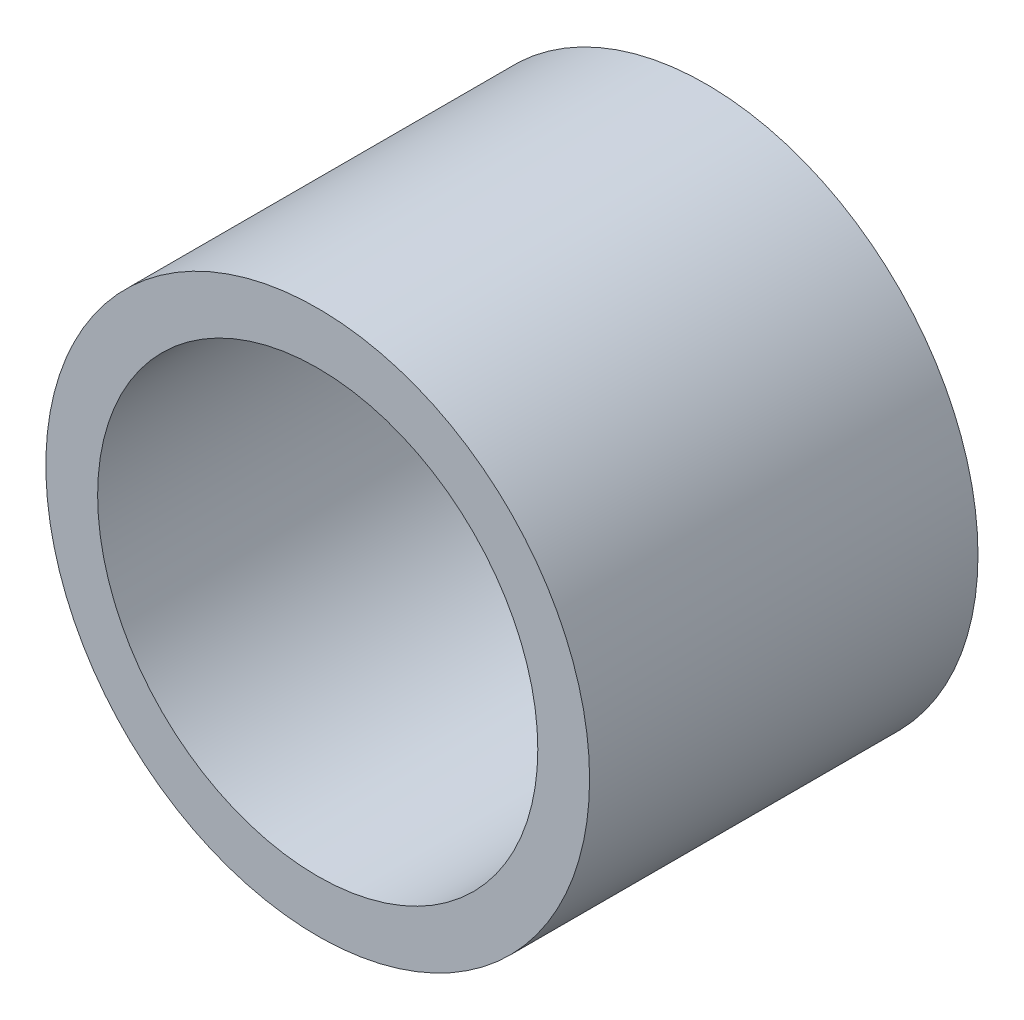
ISO-10303-21;
HEADER;
FILE_DESCRIPTION(('STEP AP214'),'2;1');
FILE_NAME('part.step','',(''),(''),'','','');
FILE_SCHEMA(('AUTOMOTIVE_DESIGN { 1 0 10303 214 1 1 1 1 }'));
ENDSEC;
DATA;
#1=APPLICATION_CONTEXT('core data for automotive mechanical design processes');
#2=APPLICATION_PROTOCOL_DEFINITION('international standard','automotive_design',2000,#1);
#3=PRODUCT_CONTEXT('',#1,'mechanical');
#4=PRODUCT('Part','Part','',(#3));
#5=PRODUCT_RELATED_PRODUCT_CATEGORY('part','',(#4));
#6=PRODUCT_DEFINITION_FORMATION('','',#4);
#7=PRODUCT_DEFINITION_CONTEXT('part definition',#1,'design');
#8=PRODUCT_DEFINITION('design','',#6,#7);
#9=PRODUCT_DEFINITION_SHAPE('','',#8);
#10=(LENGTH_UNIT() NAMED_UNIT(*) SI_UNIT(.MILLI.,.METRE.));
#11=(NAMED_UNIT(*) PLANE_ANGLE_UNIT() SI_UNIT($,.RADIAN.));
#12=(NAMED_UNIT(*) SI_UNIT($,.STERADIAN.) SOLID_ANGLE_UNIT());
#13=UNCERTAINTY_MEASURE_WITH_UNIT(LENGTH_MEASURE(1.E-05),#10,'distance_accuracy_value','');
#14=(GEOMETRIC_REPRESENTATION_CONTEXT(3) GLOBAL_UNCERTAINTY_ASSIGNED_CONTEXT((#13)) GLOBAL_UNIT_ASSIGNED_CONTEXT((#10,
#11,#12)) REPRESENTATION_CONTEXT('',''));
#15=CARTESIAN_POINT('',(0.,0.,0.));
#16=DIRECTION('',(0.,0.,1.));
#17=DIRECTION('',(1.,0.,0.));
#18=AXIS2_PLACEMENT_3D('',#15,#16,#17);
#19=CARTESIAN_POINT('',(0.,0.,30.));
#20=DIRECTION('',(0.,0.,-1.));
#21=DIRECTION('',(-1.,0.,0.));
#22=AXIS2_PLACEMENT_3D('',#19,#20,#21);
#23=CYLINDRICAL_SURFACE('',#22,21.);
#24=CARTESIAN_POINT('',(0.,0.,30.));
#25=DIRECTION('',(0.,0.,1.));
#26=DIRECTION('',(1.,0.,0.));
#27=AXIS2_PLACEMENT_3D('',#24,#25,#26);
#28=CIRCLE('',#27,21.);
#29=CARTESIAN_POINT('',(21.,0.,30.));
#30=VERTEX_POINT('',#29);
#31=EDGE_CURVE('E10',#30,#30,#28,.T.);
#32=ORIENTED_EDGE('',*,*,#31,.F.);
#33=EDGE_LOOP('',(#32));
#34=FACE_BOUND('',#33,.T.);
#35=CARTESIAN_POINT('',(0.,0.,0.));
#36=DIRECTION('',(0.,0.,1.));
#37=DIRECTION('',(1.,0.,0.));
#38=AXIS2_PLACEMENT_3D('',#35,#36,#37);
#39=CIRCLE('',#38,21.);
#40=CARTESIAN_POINT('',(21.,0.,0.));
#41=VERTEX_POINT('',#40);
#42=EDGE_CURVE('E21',#41,#41,#39,.T.);
#43=ORIENTED_EDGE('',*,*,#42,.T.);
#44=EDGE_LOOP('',(#43));
#45=FACE_BOUND('',#44,.T.);
#46=ADVANCED_FACE('F15',(#34,#45),#23,.T.);
#47=CARTESIAN_POINT('',(0.,0.,30.));
#48=DIRECTION('',(0.,0.,1.));
#49=DIRECTION('',(1.,0.,0.));
#50=AXIS2_PLACEMENT_3D('',#47,#48,#49);
#51=PLANE('',#50);
#52=CARTESIAN_POINT('',(0.,0.,30.));
#53=DIRECTION('',(0.,0.,1.));
#54=DIRECTION('',(1.,0.,0.));
#55=AXIS2_PLACEMENT_3D('',#52,#53,#54);
#56=CIRCLE('',#55,17.);
#57=CARTESIAN_POINT('',(17.,0.,30.));
#58=VERTEX_POINT('',#57);
#59=EDGE_CURVE('E29',#58,#58,#56,.T.);
#60=ORIENTED_EDGE('',*,*,#59,.F.);
#61=EDGE_LOOP('',(#60));
#62=FACE_BOUND('',#61,.T.);
#63=ORIENTED_EDGE('',*,*,#31,.T.);
#64=EDGE_LOOP('',(#63));
#65=FACE_BOUND('',#64,.T.);
#66=ADVANCED_FACE('F37',(#62,#65),#51,.T.);
#67=CARTESIAN_POINT('',(0.,0.,0.));
#68=DIRECTION('',(0.,0.,1.));
#69=DIRECTION('',(1.,0.,0.));
#70=AXIS2_PLACEMENT_3D('',#67,#68,#69);
#71=PLANE('',#70);
#72=CARTESIAN_POINT('',(0.,0.,0.));
#73=DIRECTION('',(0.,0.,1.));
#74=DIRECTION('',(1.,0.,0.));
#75=AXIS2_PLACEMENT_3D('',#72,#73,#74);
#76=CIRCLE('',#75,17.);
#77=CARTESIAN_POINT('',(17.,0.,0.));
#78=VERTEX_POINT('',#77);
#79=EDGE_CURVE('E25',#78,#78,#76,.T.);
#80=ORIENTED_EDGE('',*,*,#79,.T.);
#81=EDGE_LOOP('',(#80));
#82=FACE_BOUND('',#81,.T.);
#83=ORIENTED_EDGE('',*,*,#42,.F.);
#84=EDGE_LOOP('',(#83));
#85=FACE_BOUND('',#84,.T.);
#86=ADVANCED_FACE('F39',(#82,#85),#71,.F.);
#87=CARTESIAN_POINT('',(0.,0.,0.));
#88=DIRECTION('',(0.,0.,1.));
#89=DIRECTION('',(1.,0.,0.));
#90=AXIS2_PLACEMENT_3D('',#87,#88,#89);
#91=CYLINDRICAL_SURFACE('',#90,17.);
#92=ORIENTED_EDGE('',*,*,#79,.F.);
#93=EDGE_LOOP('',(#92));
#94=FACE_BOUND('',#93,.T.);
#95=ORIENTED_EDGE('',*,*,#59,.T.);
#96=EDGE_LOOP('',(#95));
#97=FACE_BOUND('',#96,.T.);
#98=ADVANCED_FACE('F35',(#94,#97),#91,.F.);
#99=CLOSED_SHELL('',(#46,#66,#86,#98));
#100=MANIFOLD_SOLID_BREP('B1',#99);
#101=ADVANCED_BREP_SHAPE_REPRESENTATION('',(#18,#100),#14);
#102=SHAPE_DEFINITION_REPRESENTATION(#9,#101);
ENDSEC;
END-ISO-10303-21;
